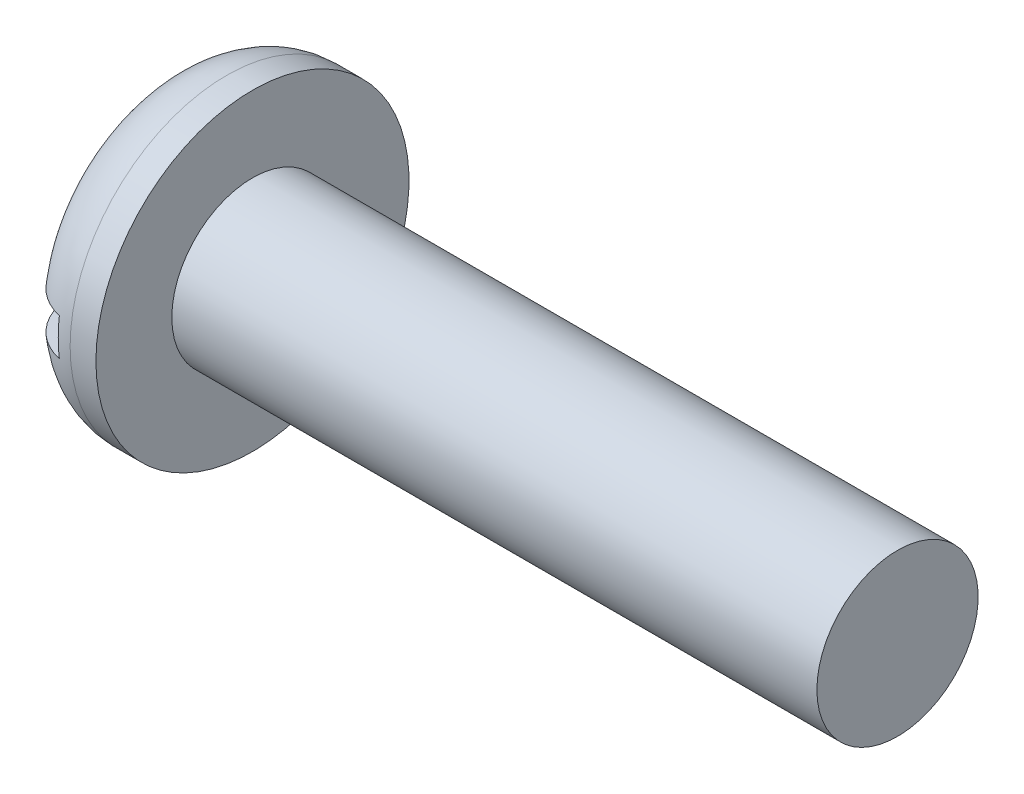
from build123d import *

# Parameters (mm, degrees)
SKETCH2_W  = 18.4912
SKETCH2_H  = 2.2098
SLOT_DEPTH = 2.8448


with BuildPart() as part:
    # BodySke → Base-Revolve (revolve)
    with BuildSketch(Plane.XY, mode=Mode.PRIVATE) as base_revolve_sk:
        with BuildLine():
            Line((5.1562, 4.7625), (5.1562, 9.2456))
            Line((5.1562, 9.2456), (3.6322, 9.2456))
            ThreePointArc((3.6322, 9.2456), (1.063846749, 8.181753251), (0, 5.6134))
            Line((0, 5.6134), (0, 0))
            Line((0, 0), (43.2562, 0))
            Line((43.2562, 0), (43.2562, 4.7625))
            Line((43.2562, 4.7625), (5.1562, 4.7625))
        make_face()
    revolve(base_revolve_sk.sketch.rotate(Axis((-25.4, 0, 0), (1, 0, 0)), 90), axis=Axis((-25.4, 0, 0), (1, 0, 0)))

    # Sketch2 → Slot (cut)
    with BuildSketch(Plane(origin=(0, 0, 0), x_dir=(0, 0, -1), z_dir=(1, 0, 0))):
        Rectangle(SKETCH2_W, SKETCH2_H)
    extrude(amount=SLOT_DEPTH, mode=Mode.SUBTRACT)


solid = part.part
